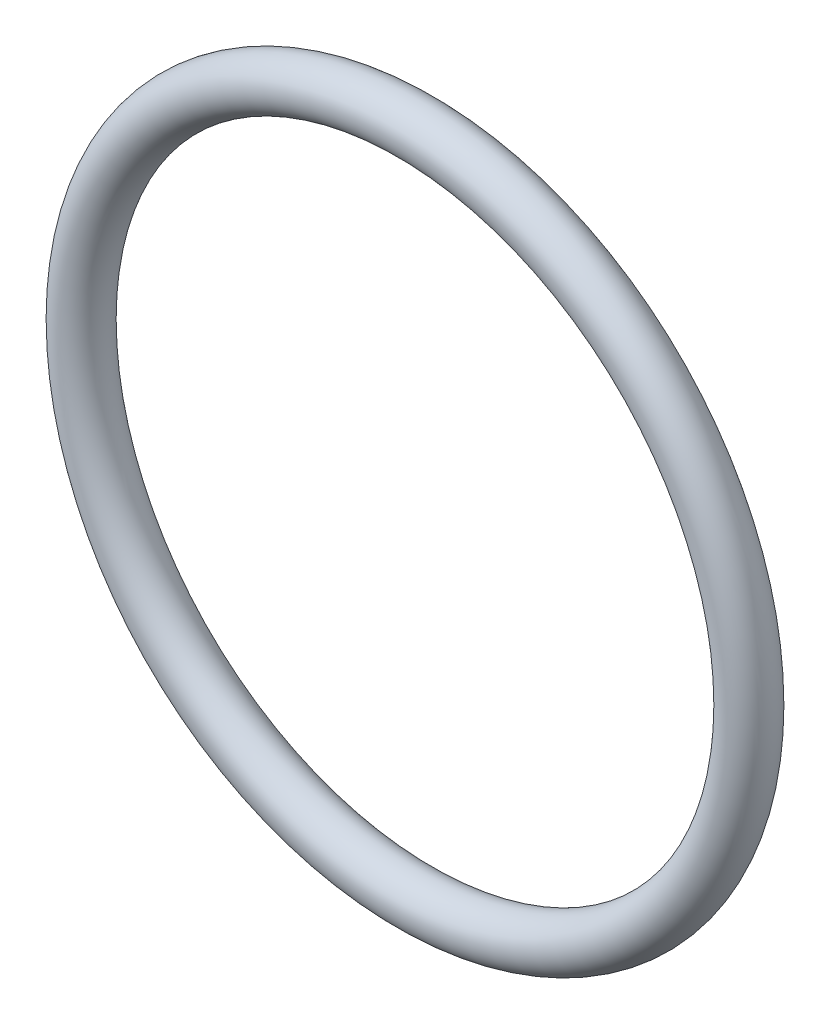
from build123d import *

# Parameters (mm, degrees)
SKETCH1_R = 1.7653


with BuildPart() as part:
    # Sketch1 → Revolve1 (revolve)
    with BuildSketch(Plane(origin=(0, 0, 0), x_dir=(0, -1, 0), z_dir=(1, 0, 0)), mode=Mode.PRIVATE) as revolve1_sk:
        with Locations((23.7871, 0)):
            Circle(SKETCH1_R)
    revolve(revolve1_sk.sketch.rotate(Axis((0, 0, 1.7653), (0, 0, -1)), 270), axis=Axis((0, 0, 1.7653), (0, 0, -1)))


solid = part.part
